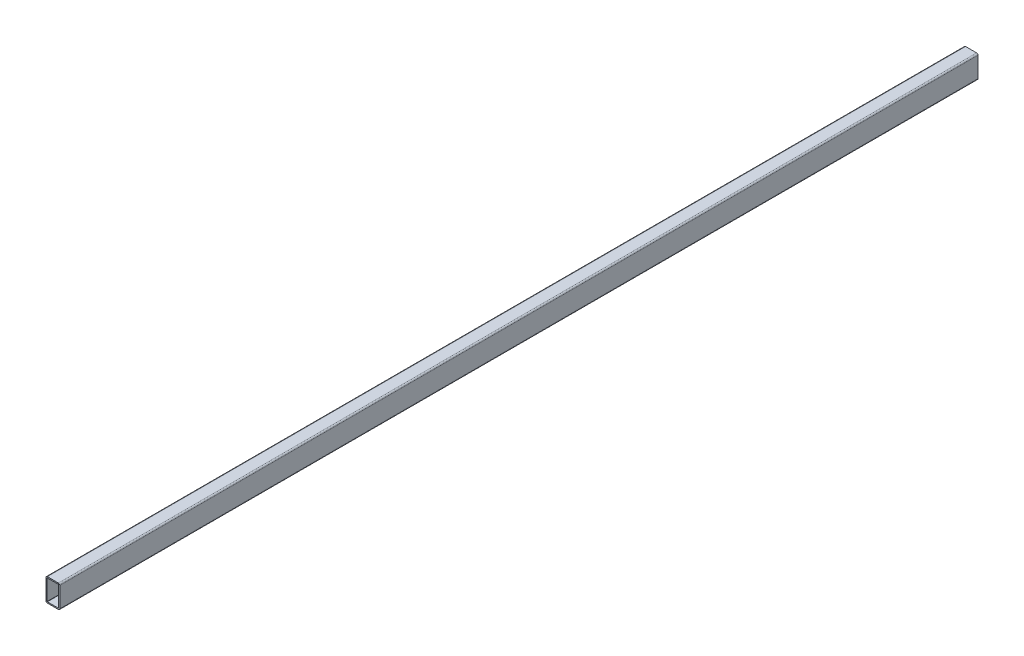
ISO-10303-21;
HEADER;
FILE_DESCRIPTION(('STEP AP214'),'2;1');
FILE_NAME('part.step','',(''),(''),'','','');
FILE_SCHEMA(('AUTOMOTIVE_DESIGN { 1 0 10303 214 1 1 1 1 }'));
ENDSEC;
DATA;
#1=APPLICATION_CONTEXT('core data for automotive mechanical design processes');
#2=APPLICATION_PROTOCOL_DEFINITION('international standard','automotive_design',2000,#1);
#3=PRODUCT_CONTEXT('',#1,'mechanical');
#4=PRODUCT('Part','Part','',(#3));
#5=PRODUCT_RELATED_PRODUCT_CATEGORY('part','',(#4));
#6=PRODUCT_DEFINITION_FORMATION('','',#4);
#7=PRODUCT_DEFINITION_CONTEXT('part definition',#1,'design');
#8=PRODUCT_DEFINITION('design','',#6,#7);
#9=PRODUCT_DEFINITION_SHAPE('','',#8);
#10=(LENGTH_UNIT() NAMED_UNIT(*) SI_UNIT(.MILLI.,.METRE.));
#11=(NAMED_UNIT(*) PLANE_ANGLE_UNIT() SI_UNIT($,.RADIAN.));
#12=(NAMED_UNIT(*) SI_UNIT($,.STERADIAN.) SOLID_ANGLE_UNIT());
#13=UNCERTAINTY_MEASURE_WITH_UNIT(LENGTH_MEASURE(1.E-05),#10,'distance_accuracy_value','');
#14=(GEOMETRIC_REPRESENTATION_CONTEXT(3) GLOBAL_UNCERTAINTY_ASSIGNED_CONTEXT((#13)) GLOBAL_UNIT_ASSIGNED_CONTEXT((#10,
#11,#12)) REPRESENTATION_CONTEXT('',''));
#15=CARTESIAN_POINT('',(0.,0.,0.));
#16=DIRECTION('',(0.,0.,1.));
#17=DIRECTION('',(1.,0.,0.));
#18=AXIS2_PLACEMENT_3D('',#15,#16,#17);
#19=CARTESIAN_POINT('',(-27.,-3.,2000.));
#20=DIRECTION('',(0.,0.,1.));
#21=DIRECTION('',(1.,0.,0.));
#22=AXIS2_PLACEMENT_3D('',#19,#20,#21);
#23=PLANE('',#22);
#24=CARTESIAN_POINT('',(-27.,-3.,2000.));
#25=DIRECTION('',(0.,0.,1.));
#26=DIRECTION('',(1.,0.,0.));
#27=AXIS2_PLACEMENT_3D('',#24,#25,#26);
#28=CIRCLE('',#27,3.);
#29=CARTESIAN_POINT('',(-27.,0.,2000.));
#30=VERTEX_POINT('',#29);
#31=CARTESIAN_POINT('',(-30.,-3.,2000.));
#32=VERTEX_POINT('',#31);
#33=EDGE_CURVE('E214',#30,#32,#28,.T.);
#34=ORIENTED_EDGE('',*,*,#33,.T.);
#35=DIRECTION('',(0.,-1.,0.));
#36=VECTOR('',#35,1.);
#37=CARTESIAN_POINT('',(-30.,-3.,2000.));
#38=LINE('',#37,#36);
#39=CARTESIAN_POINT('',(-30.,-47.,2000.));
#40=VERTEX_POINT('',#39);
#41=EDGE_CURVE('E217',#32,#40,#38,.T.);
#42=ORIENTED_EDGE('',*,*,#41,.T.);
#43=CARTESIAN_POINT('',(-27.,-47.,2000.));
#44=DIRECTION('',(0.,0.,1.));
#45=DIRECTION('',(-1.,0.,0.));
#46=AXIS2_PLACEMENT_3D('',#43,#44,#45);
#47=CIRCLE('',#46,3.);
#48=CARTESIAN_POINT('',(-27.,-50.,2000.));
#49=VERTEX_POINT('',#48);
#50=EDGE_CURVE('E220',#40,#49,#47,.T.);
#51=ORIENTED_EDGE('',*,*,#50,.T.);
#52=DIRECTION('',(1.,0.,0.));
#53=VECTOR('',#52,1.);
#54=CARTESIAN_POINT('',(-2.99999999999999,-50.,2000.));
#55=LINE('',#54,#53);
#56=CARTESIAN_POINT('',(-2.99999999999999,-50.,2000.));
#57=VERTEX_POINT('',#56);
#58=EDGE_CURVE('E222',#49,#57,#55,.T.);
#59=ORIENTED_EDGE('',*,*,#58,.T.);
#60=CARTESIAN_POINT('',(-2.99999999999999,-47.,2000.));
#61=DIRECTION('',(0.,0.,1.));
#62=DIRECTION('',(-1.,0.,0.));
#63=AXIS2_PLACEMENT_3D('',#60,#61,#62);
#64=CIRCLE('',#63,3.);
#65=CARTESIAN_POINT('',(0.,-47.,2000.));
#66=VERTEX_POINT('',#65);
#67=EDGE_CURVE('E224',#57,#66,#64,.T.);
#68=ORIENTED_EDGE('',*,*,#67,.T.);
#69=DIRECTION('',(0.,1.,0.));
#70=VECTOR('',#69,1.);
#71=CARTESIAN_POINT('',(0.,-3.,2000.));
#72=LINE('',#71,#70);
#73=CARTESIAN_POINT('',(0.,-3.,2000.));
#74=VERTEX_POINT('',#73);
#75=EDGE_CURVE('E226',#66,#74,#72,.T.);
#76=ORIENTED_EDGE('',*,*,#75,.T.);
#77=CARTESIAN_POINT('',(-3.,-3.,2000.));
#78=DIRECTION('',(0.,0.,1.));
#79=DIRECTION('',(-1.,0.,0.));
#80=AXIS2_PLACEMENT_3D('',#77,#78,#79);
#81=CIRCLE('',#80,3.);
#82=CARTESIAN_POINT('',(-3.,0.,2000.));
#83=VERTEX_POINT('',#82);
#84=EDGE_CURVE('E228',#74,#83,#81,.T.);
#85=ORIENTED_EDGE('',*,*,#84,.T.);
#86=DIRECTION('',(-1.,0.,0.));
#87=VECTOR('',#86,1.);
#88=CARTESIAN_POINT('',(-3.,0.,2000.));
#89=LINE('',#88,#87);
#90=EDGE_CURVE('E230',#83,#30,#89,.T.);
#91=ORIENTED_EDGE('',*,*,#90,.T.);
#92=EDGE_LOOP('',(#34,#42,#51,#59,#68,#76,#85,#91));
#93=FACE_BOUND('',#92,.T.);
#94=DIRECTION('',(-1.,0.,0.));
#95=VECTOR('',#94,1.);
#96=CARTESIAN_POINT('',(-3.,-2.5,2000.));
#97=LINE('',#96,#95);
#98=CARTESIAN_POINT('',(-3.,-2.5,2000.));
#99=VERTEX_POINT('',#98);
#100=CARTESIAN_POINT('',(-27.,-2.5,2000.));
#101=VERTEX_POINT('',#100);
#102=EDGE_CURVE('E157',#99,#101,#97,.T.);
#103=ORIENTED_EDGE('',*,*,#102,.F.);
#104=CARTESIAN_POINT('',(-3.,-3.,2000.));
#105=DIRECTION('',(0.,0.,1.));
#106=DIRECTION('',(-1.,0.,0.));
#107=AXIS2_PLACEMENT_3D('',#104,#105,#106);
#108=CIRCLE('',#107,0.5);
#109=CARTESIAN_POINT('',(-2.5,-3.,2000.));
#110=VERTEX_POINT('',#109);
#111=EDGE_CURVE('E149',#110,#99,#108,.T.);
#112=ORIENTED_EDGE('',*,*,#111,.F.);
#113=DIRECTION('',(0.,1.,0.));
#114=VECTOR('',#113,1.);
#115=CARTESIAN_POINT('',(-2.5,-3.,2000.));
#116=LINE('',#115,#114);
#117=CARTESIAN_POINT('',(-2.49999999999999,-47.,2000.));
#118=VERTEX_POINT('',#117);
#119=EDGE_CURVE('E182',#118,#110,#116,.T.);
#120=ORIENTED_EDGE('',*,*,#119,.F.);
#121=CARTESIAN_POINT('',(-2.99999999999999,-47.,2000.));
#122=DIRECTION('',(0.,0.,1.));
#123=DIRECTION('',(-1.,0.,0.));
#124=AXIS2_PLACEMENT_3D('',#121,#122,#123);
#125=CIRCLE('',#124,0.5);
#126=CARTESIAN_POINT('',(-2.99999999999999,-47.5,2000.));
#127=VERTEX_POINT('',#126);
#128=EDGE_CURVE('E180',#127,#118,#125,.T.);
#129=ORIENTED_EDGE('',*,*,#128,.F.);
#130=DIRECTION('',(1.,0.,0.));
#131=VECTOR('',#130,1.);
#132=CARTESIAN_POINT('',(-2.99999999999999,-47.5,2000.));
#133=LINE('',#132,#131);
#134=CARTESIAN_POINT('',(-27.,-47.5,2000.));
#135=VERTEX_POINT('',#134);
#136=EDGE_CURVE('E178',#135,#127,#133,.T.);
#137=ORIENTED_EDGE('',*,*,#136,.F.);
#138=CARTESIAN_POINT('',(-27.,-47.,2000.));
#139=DIRECTION('',(0.,0.,1.));
#140=DIRECTION('',(-1.,0.,0.));
#141=AXIS2_PLACEMENT_3D('',#138,#139,#140);
#142=CIRCLE('',#141,0.500000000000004);
#143=CARTESIAN_POINT('',(-27.5,-47.,2000.));
#144=VERTEX_POINT('',#143);
#145=EDGE_CURVE('E176',#144,#135,#142,.T.);
#146=ORIENTED_EDGE('',*,*,#145,.F.);
#147=DIRECTION('',(0.,-1.,0.));
#148=VECTOR('',#147,1.);
#149=CARTESIAN_POINT('',(-27.5,-3.,2000.));
#150=LINE('',#149,#148);
#151=CARTESIAN_POINT('',(-27.5,-3.,2000.));
#152=VERTEX_POINT('',#151);
#153=EDGE_CURVE('E172',#152,#144,#150,.T.);
#154=ORIENTED_EDGE('',*,*,#153,.F.);
#155=CARTESIAN_POINT('',(-27.,-3.,2000.));
#156=DIRECTION('',(0.,0.,1.));
#157=DIRECTION('',(1.,0.,0.));
#158=AXIS2_PLACEMENT_3D('',#155,#156,#157);
#159=CIRCLE('',#158,0.500000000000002);
#160=EDGE_CURVE('E170',#101,#152,#159,.T.);
#161=ORIENTED_EDGE('',*,*,#160,.F.);
#162=EDGE_LOOP('',(#103,#112,#120,#129,#137,#146,#154,#161));
#163=FACE_BOUND('',#162,.T.);
#164=ADVANCED_FACE('F36',(#93,#163),#23,.T.);
#165=CARTESIAN_POINT('',(-27.,-3.,0.));
#166=DIRECTION('',(0.,0.,1.));
#167=DIRECTION('',(1.,0.,0.));
#168=AXIS2_PLACEMENT_3D('',#165,#166,#167);
#169=PLANE('',#168);
#170=CARTESIAN_POINT('',(-27.,-3.,0.));
#171=DIRECTION('',(0.,0.,1.));
#172=DIRECTION('',(1.,0.,0.));
#173=AXIS2_PLACEMENT_3D('',#170,#171,#172);
#174=CIRCLE('',#173,3.);
#175=CARTESIAN_POINT('',(-27.,0.,0.));
#176=VERTEX_POINT('',#175);
#177=CARTESIAN_POINT('',(-30.,-3.,0.));
#178=VERTEX_POINT('',#177);
#179=EDGE_CURVE('E165',#176,#178,#174,.T.);
#180=ORIENTED_EDGE('',*,*,#179,.F.);
#181=DIRECTION('',(-1.,0.,0.));
#182=VECTOR('',#181,1.);
#183=CARTESIAN_POINT('',(-3.,0.,0.));
#184=LINE('',#183,#182);
#185=CARTESIAN_POINT('',(-3.,0.,0.));
#186=VERTEX_POINT('',#185);
#187=EDGE_CURVE('E218',#186,#176,#184,.T.);
#188=ORIENTED_EDGE('',*,*,#187,.F.);
#189=CARTESIAN_POINT('',(-3.,-3.,0.));
#190=DIRECTION('',(0.,0.,1.));
#191=DIRECTION('',(-1.,0.,0.));
#192=AXIS2_PLACEMENT_3D('',#189,#190,#191);
#193=CIRCLE('',#192,3.);
#194=CARTESIAN_POINT('',(0.,-3.,0.));
#195=VERTEX_POINT('',#194);
#196=EDGE_CURVE('E245',#195,#186,#193,.T.);
#197=ORIENTED_EDGE('',*,*,#196,.F.);
#198=DIRECTION('',(0.,1.,0.));
#199=VECTOR('',#198,1.);
#200=CARTESIAN_POINT('',(0.,-3.,0.));
#201=LINE('',#200,#199);
#202=CARTESIAN_POINT('',(0.,-47.,0.));
#203=VERTEX_POINT('',#202);
#204=EDGE_CURVE('E243',#203,#195,#201,.T.);
#205=ORIENTED_EDGE('',*,*,#204,.F.);
#206=CARTESIAN_POINT('',(-2.99999999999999,-47.,0.));
#207=DIRECTION('',(0.,0.,1.));
#208=DIRECTION('',(-1.,0.,0.));
#209=AXIS2_PLACEMENT_3D('',#206,#207,#208);
#210=CIRCLE('',#209,3.);
#211=CARTESIAN_POINT('',(-2.99999999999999,-50.,0.));
#212=VERTEX_POINT('',#211);
#213=EDGE_CURVE('E241',#212,#203,#210,.T.);
#214=ORIENTED_EDGE('',*,*,#213,.F.);
#215=DIRECTION('',(1.,0.,0.));
#216=VECTOR('',#215,1.);
#217=CARTESIAN_POINT('',(-2.99999999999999,-50.,0.));
#218=LINE('',#217,#216);
#219=CARTESIAN_POINT('',(-27.,-50.,0.));
#220=VERTEX_POINT('',#219);
#221=EDGE_CURVE('E239',#220,#212,#218,.T.);
#222=ORIENTED_EDGE('',*,*,#221,.F.);
#223=CARTESIAN_POINT('',(-27.,-47.,0.));
#224=DIRECTION('',(0.,0.,1.));
#225=DIRECTION('',(-1.,0.,0.));
#226=AXIS2_PLACEMENT_3D('',#223,#224,#225);
#227=CIRCLE('',#226,3.);
#228=CARTESIAN_POINT('',(-30.,-47.,0.));
#229=VERTEX_POINT('',#228);
#230=EDGE_CURVE('E237',#229,#220,#227,.T.);
#231=ORIENTED_EDGE('',*,*,#230,.F.);
#232=DIRECTION('',(0.,-1.,0.));
#233=VECTOR('',#232,1.);
#234=CARTESIAN_POINT('',(-30.,-3.,0.));
#235=LINE('',#234,#233);
#236=EDGE_CURVE('E235',#178,#229,#235,.T.);
#237=ORIENTED_EDGE('',*,*,#236,.F.);
#238=EDGE_LOOP('',(#180,#188,#197,#205,#214,#222,#231,#237));
#239=FACE_BOUND('',#238,.T.);
#240=CARTESIAN_POINT('',(-3.,-3.,0.));
#241=DIRECTION('',(0.,0.,1.));
#242=DIRECTION('',(-1.,0.,0.));
#243=AXIS2_PLACEMENT_3D('',#240,#241,#242);
#244=CIRCLE('',#243,0.5);
#245=CARTESIAN_POINT('',(-2.5,-3.,0.));
#246=VERTEX_POINT('',#245);
#247=CARTESIAN_POINT('',(-3.,-2.5,0.));
#248=VERTEX_POINT('',#247);
#249=EDGE_CURVE('E59',#246,#248,#244,.T.);
#250=ORIENTED_EDGE('',*,*,#249,.T.);
#251=DIRECTION('',(-1.,0.,0.));
#252=VECTOR('',#251,1.);
#253=CARTESIAN_POINT('',(-3.,-2.5,0.));
#254=LINE('',#253,#252);
#255=CARTESIAN_POINT('',(-27.,-2.5,0.));
#256=VERTEX_POINT('',#255);
#257=EDGE_CURVE('E164',#248,#256,#254,.T.);
#258=ORIENTED_EDGE('',*,*,#257,.T.);
#259=CARTESIAN_POINT('',(-27.,-3.,0.));
#260=DIRECTION('',(0.,0.,1.));
#261=DIRECTION('',(1.,0.,0.));
#262=AXIS2_PLACEMENT_3D('',#259,#260,#261);
#263=CIRCLE('',#262,0.500000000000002);
#264=CARTESIAN_POINT('',(-27.5,-3.,0.));
#265=VERTEX_POINT('',#264);
#266=EDGE_CURVE('E186',#256,#265,#263,.T.);
#267=ORIENTED_EDGE('',*,*,#266,.T.);
#268=DIRECTION('',(0.,-1.,0.));
#269=VECTOR('',#268,1.);
#270=CARTESIAN_POINT('',(-27.5,-3.,0.));
#271=LINE('',#270,#269);
#272=CARTESIAN_POINT('',(-27.5,-47.,0.));
#273=VERTEX_POINT('',#272);
#274=EDGE_CURVE('E189',#265,#273,#271,.T.);
#275=ORIENTED_EDGE('',*,*,#274,.T.);
#276=CARTESIAN_POINT('',(-27.,-47.,0.));
#277=DIRECTION('',(0.,0.,1.));
#278=DIRECTION('',(-1.,0.,0.));
#279=AXIS2_PLACEMENT_3D('',#276,#277,#278);
#280=CIRCLE('',#279,0.500000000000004);
#281=CARTESIAN_POINT('',(-27.,-47.5,0.));
#282=VERTEX_POINT('',#281);
#283=EDGE_CURVE('E192',#273,#282,#280,.T.);
#284=ORIENTED_EDGE('',*,*,#283,.T.);
#285=DIRECTION('',(1.,0.,0.));
#286=VECTOR('',#285,1.);
#287=CARTESIAN_POINT('',(-2.99999999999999,-47.5,0.));
#288=LINE('',#287,#286);
#289=CARTESIAN_POINT('',(-2.99999999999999,-47.5,0.));
#290=VERTEX_POINT('',#289);
#291=EDGE_CURVE('E195',#282,#290,#288,.T.);
#292=ORIENTED_EDGE('',*,*,#291,.T.);
#293=CARTESIAN_POINT('',(-2.99999999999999,-47.,0.));
#294=DIRECTION('',(0.,0.,1.));
#295=DIRECTION('',(-1.,0.,0.));
#296=AXIS2_PLACEMENT_3D('',#293,#294,#295);
#297=CIRCLE('',#296,0.5);
#298=CARTESIAN_POINT('',(-2.49999999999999,-47.,0.));
#299=VERTEX_POINT('',#298);
#300=EDGE_CURVE('E198',#290,#299,#297,.T.);
#301=ORIENTED_EDGE('',*,*,#300,.T.);
#302=DIRECTION('',(0.,1.,0.));
#303=VECTOR('',#302,1.);
#304=CARTESIAN_POINT('',(-2.5,-3.,0.));
#305=LINE('',#304,#303);
#306=EDGE_CURVE('E158',#299,#246,#305,.T.);
#307=ORIENTED_EDGE('',*,*,#306,.T.);
#308=EDGE_LOOP('',(#250,#258,#267,#275,#284,#292,#301,#307));
#309=FACE_BOUND('',#308,.T.);
#310=ADVANCED_FACE('F275',(#239,#309),#169,.F.);
#311=CARTESIAN_POINT('',(-27.,-3.,2000.));
#312=DIRECTION('',(0.,0.,-1.));
#313=DIRECTION('',(-1.,0.,0.));
#314=AXIS2_PLACEMENT_3D('',#311,#312,#313);
#315=CYLINDRICAL_SURFACE('',#314,3.);
#316=ORIENTED_EDGE('',*,*,#179,.T.);
#317=DIRECTION('',(0.,0.,-1.));
#318=VECTOR('',#317,1.);
#319=CARTESIAN_POINT('',(-30.,-3.,2000.));
#320=LINE('',#319,#318);
#321=EDGE_CURVE('E11',#32,#178,#320,.T.);
#322=ORIENTED_EDGE('',*,*,#321,.F.);
#323=ORIENTED_EDGE('',*,*,#33,.F.);
#324=DIRECTION('',(0.,0.,-1.));
#325=VECTOR('',#324,1.);
#326=CARTESIAN_POINT('',(-27.,0.,2000.));
#327=LINE('',#326,#325);
#328=EDGE_CURVE('E232',#30,#176,#327,.T.);
#329=ORIENTED_EDGE('',*,*,#328,.T.);
#330=EDGE_LOOP('',(#316,#322,#323,#329));
#331=FACE_BOUND('',#330,.T.);
#332=ADVANCED_FACE('F38',(#331),#315,.T.);
#333=CARTESIAN_POINT('',(-30.,-3.,2000.));
#334=DIRECTION('',(1.,0.,0.));
#335=DIRECTION('',(0.,1.,0.));
#336=AXIS2_PLACEMENT_3D('',#333,#334,#335);
#337=PLANE('',#336);
#338=ORIENTED_EDGE('',*,*,#236,.T.);
#339=DIRECTION('',(0.,0.,-1.));
#340=VECTOR('',#339,1.);
#341=CARTESIAN_POINT('',(-30.,-47.,2000.));
#342=LINE('',#341,#340);
#343=EDGE_CURVE('E44',#40,#229,#342,.T.);
#344=ORIENTED_EDGE('',*,*,#343,.F.);
#345=ORIENTED_EDGE('',*,*,#41,.F.);
#346=ORIENTED_EDGE('',*,*,#321,.T.);
#347=EDGE_LOOP('',(#338,#344,#345,#346));
#348=FACE_BOUND('',#347,.T.);
#349=ADVANCED_FACE('F292',(#348),#337,.F.);
#350=CARTESIAN_POINT('',(-27.,-47.,2000.));
#351=DIRECTION('',(0.,0.,-1.));
#352=DIRECTION('',(-1.,0.,0.));
#353=AXIS2_PLACEMENT_3D('',#350,#351,#352);
#354=CYLINDRICAL_SURFACE('',#353,3.);
#355=ORIENTED_EDGE('',*,*,#230,.T.);
#356=DIRECTION('',(0.,0.,-1.));
#357=VECTOR('',#356,1.);
#358=CARTESIAN_POINT('',(-27.,-50.,2000.));
#359=LINE('',#358,#357);
#360=EDGE_CURVE('E262',#49,#220,#359,.T.);
#361=ORIENTED_EDGE('',*,*,#360,.F.);
#362=ORIENTED_EDGE('',*,*,#50,.F.);
#363=ORIENTED_EDGE('',*,*,#343,.T.);
#364=EDGE_LOOP('',(#355,#361,#362,#363));
#365=FACE_BOUND('',#364,.T.);
#366=ADVANCED_FACE('F269',(#365),#354,.T.);
#367=CARTESIAN_POINT('',(-2.99999999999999,-50.,2000.));
#368=DIRECTION('',(0.,1.,0.));
#369=DIRECTION('',(-1.,0.,0.));
#370=AXIS2_PLACEMENT_3D('',#367,#368,#369);
#371=PLANE('',#370);
#372=ORIENTED_EDGE('',*,*,#221,.T.);
#373=DIRECTION('',(0.,0.,-1.));
#374=VECTOR('',#373,1.);
#375=CARTESIAN_POINT('',(-2.99999999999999,-50.,2000.));
#376=LINE('',#375,#374);
#377=EDGE_CURVE('E259',#57,#212,#376,.T.);
#378=ORIENTED_EDGE('',*,*,#377,.F.);
#379=ORIENTED_EDGE('',*,*,#58,.F.);
#380=ORIENTED_EDGE('',*,*,#360,.T.);
#381=EDGE_LOOP('',(#372,#378,#379,#380));
#382=FACE_BOUND('',#381,.T.);
#383=ADVANCED_FACE('F281',(#382),#371,.F.);
#384=CARTESIAN_POINT('',(-2.99999999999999,-47.,2000.));
#385=DIRECTION('',(0.,0.,-1.));
#386=DIRECTION('',(-1.,0.,0.));
#387=AXIS2_PLACEMENT_3D('',#384,#385,#386);
#388=CYLINDRICAL_SURFACE('',#387,3.);
#389=ORIENTED_EDGE('',*,*,#213,.T.);
#390=DIRECTION('',(0.,0.,-1.));
#391=VECTOR('',#390,1.);
#392=CARTESIAN_POINT('',(0.,-47.,2000.));
#393=LINE('',#392,#391);
#394=EDGE_CURVE('E256',#66,#203,#393,.T.);
#395=ORIENTED_EDGE('',*,*,#394,.F.);
#396=ORIENTED_EDGE('',*,*,#67,.F.);
#397=ORIENTED_EDGE('',*,*,#377,.T.);
#398=EDGE_LOOP('',(#389,#395,#396,#397));
#399=FACE_BOUND('',#398,.T.);
#400=ADVANCED_FACE('F285',(#399),#388,.T.);
#401=CARTESIAN_POINT('',(0.,-3.,2000.));
#402=DIRECTION('',(-1.,0.,0.));
#403=DIRECTION('',(0.,-1.,0.));
#404=AXIS2_PLACEMENT_3D('',#401,#402,#403);
#405=PLANE('',#404);
#406=ORIENTED_EDGE('',*,*,#204,.T.);
#407=DIRECTION('',(0.,0.,-1.));
#408=VECTOR('',#407,1.);
#409=CARTESIAN_POINT('',(0.,-3.,2000.));
#410=LINE('',#409,#408);
#411=EDGE_CURVE('E253',#74,#195,#410,.T.);
#412=ORIENTED_EDGE('',*,*,#411,.F.);
#413=ORIENTED_EDGE('',*,*,#75,.F.);
#414=ORIENTED_EDGE('',*,*,#394,.T.);
#415=EDGE_LOOP('',(#406,#412,#413,#414));
#416=FACE_BOUND('',#415,.T.);
#417=ADVANCED_FACE('F305',(#416),#405,.F.);
#418=CARTESIAN_POINT('',(-3.,-3.,2000.));
#419=DIRECTION('',(0.,0.,-1.));
#420=DIRECTION('',(-1.,0.,0.));
#421=AXIS2_PLACEMENT_3D('',#418,#419,#420);
#422=CYLINDRICAL_SURFACE('',#421,3.);
#423=ORIENTED_EDGE('',*,*,#196,.T.);
#424=DIRECTION('',(0.,0.,-1.));
#425=VECTOR('',#424,1.);
#426=CARTESIAN_POINT('',(-3.,0.,2000.));
#427=LINE('',#426,#425);
#428=EDGE_CURVE('E250',#83,#186,#427,.T.);
#429=ORIENTED_EDGE('',*,*,#428,.F.);
#430=ORIENTED_EDGE('',*,*,#84,.F.);
#431=ORIENTED_EDGE('',*,*,#411,.T.);
#432=EDGE_LOOP('',(#423,#429,#430,#431));
#433=FACE_BOUND('',#432,.T.);
#434=ADVANCED_FACE('F303',(#433),#422,.T.);
#435=CARTESIAN_POINT('',(-3.,0.,2000.));
#436=DIRECTION('',(0.,-1.,0.));
#437=DIRECTION('',(1.,0.,0.));
#438=AXIS2_PLACEMENT_3D('',#435,#436,#437);
#439=PLANE('',#438);
#440=ORIENTED_EDGE('',*,*,#187,.T.);
#441=ORIENTED_EDGE('',*,*,#328,.F.);
#442=ORIENTED_EDGE('',*,*,#90,.F.);
#443=ORIENTED_EDGE('',*,*,#428,.T.);
#444=EDGE_LOOP('',(#440,#441,#442,#443));
#445=FACE_BOUND('',#444,.T.);
#446=ADVANCED_FACE('F298',(#445),#439,.F.);
#447=CARTESIAN_POINT('',(-3.,-3.,2000.));
#448=DIRECTION('',(0.,0.,-1.));
#449=DIRECTION('',(-1.,0.,0.));
#450=AXIS2_PLACEMENT_3D('',#447,#448,#449);
#451=CYLINDRICAL_SURFACE('',#450,0.5);
#452=ORIENTED_EDGE('',*,*,#249,.F.);
#453=DIRECTION('',(0.,0.,-1.));
#454=VECTOR('',#453,1.);
#455=CARTESIAN_POINT('',(-2.5,-3.,2000.));
#456=LINE('',#455,#454);
#457=EDGE_CURVE('E153',#110,#246,#456,.T.);
#458=ORIENTED_EDGE('',*,*,#457,.F.);
#459=ORIENTED_EDGE('',*,*,#111,.T.);
#460=DIRECTION('',(0.,0.,-1.));
#461=VECTOR('',#460,1.);
#462=CARTESIAN_POINT('',(-3.,-2.5,2000.));
#463=LINE('',#462,#461);
#464=EDGE_CURVE('E152',#99,#248,#463,.T.);
#465=ORIENTED_EDGE('',*,*,#464,.T.);
#466=EDGE_LOOP('',(#452,#458,#459,#465));
#467=FACE_BOUND('',#466,.T.);
#468=ADVANCED_FACE('F151',(#467),#451,.F.);
#469=CARTESIAN_POINT('',(-3.,-2.5,2000.));
#470=DIRECTION('',(0.,-1.,0.));
#471=DIRECTION('',(0.,0.,-1.));
#472=AXIS2_PLACEMENT_3D('',#469,#470,#471);
#473=PLANE('',#472);
#474=ORIENTED_EDGE('',*,*,#257,.F.);
#475=ORIENTED_EDGE('',*,*,#464,.F.);
#476=ORIENTED_EDGE('',*,*,#102,.T.);
#477=DIRECTION('',(0.,0.,-1.));
#478=VECTOR('',#477,1.);
#479=CARTESIAN_POINT('',(-27.,-2.5,2000.));
#480=LINE('',#479,#478);
#481=EDGE_CURVE('E166',#101,#256,#480,.T.);
#482=ORIENTED_EDGE('',*,*,#481,.T.);
#483=EDGE_LOOP('',(#474,#475,#476,#482));
#484=FACE_BOUND('',#483,.T.);
#485=ADVANCED_FACE('F161',(#484),#473,.T.);
#486=CARTESIAN_POINT('',(-27.,-3.,2000.));
#487=DIRECTION('',(0.,0.,-1.));
#488=DIRECTION('',(-1.,0.,0.));
#489=AXIS2_PLACEMENT_3D('',#486,#487,#488);
#490=CYLINDRICAL_SURFACE('',#489,0.500000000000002);
#491=ORIENTED_EDGE('',*,*,#266,.F.);
#492=ORIENTED_EDGE('',*,*,#481,.F.);
#493=ORIENTED_EDGE('',*,*,#160,.T.);
#494=DIRECTION('',(0.,0.,-1.));
#495=VECTOR('',#494,1.);
#496=CARTESIAN_POINT('',(-27.5,-3.,2000.));
#497=LINE('',#496,#495);
#498=EDGE_CURVE('E211',#152,#265,#497,.T.);
#499=ORIENTED_EDGE('',*,*,#498,.T.);
#500=EDGE_LOOP('',(#491,#492,#493,#499));
#501=FACE_BOUND('',#500,.T.);
#502=ADVANCED_FACE('F330',(#501),#490,.F.);
#503=CARTESIAN_POINT('',(-27.5,-3.,2000.));
#504=DIRECTION('',(1.,0.,0.));
#505=DIRECTION('',(0.,0.,-1.));
#506=AXIS2_PLACEMENT_3D('',#503,#504,#505);
#507=PLANE('',#506);
#508=ORIENTED_EDGE('',*,*,#274,.F.);
#509=ORIENTED_EDGE('',*,*,#498,.F.);
#510=ORIENTED_EDGE('',*,*,#153,.T.);
#511=DIRECTION('',(0.,0.,-1.));
#512=VECTOR('',#511,1.);
#513=CARTESIAN_POINT('',(-27.5,-47.,2000.));
#514=LINE('',#513,#512);
#515=EDGE_CURVE('E209',#144,#273,#514,.T.);
#516=ORIENTED_EDGE('',*,*,#515,.T.);
#517=EDGE_LOOP('',(#508,#509,#510,#516));
#518=FACE_BOUND('',#517,.T.);
#519=ADVANCED_FACE('F334',(#518),#507,.T.);
#520=CARTESIAN_POINT('',(-27.,-47.,2000.));
#521=DIRECTION('',(0.,0.,-1.));
#522=DIRECTION('',(-1.,0.,0.));
#523=AXIS2_PLACEMENT_3D('',#520,#521,#522);
#524=CYLINDRICAL_SURFACE('',#523,0.500000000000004);
#525=ORIENTED_EDGE('',*,*,#283,.F.);
#526=ORIENTED_EDGE('',*,*,#515,.F.);
#527=ORIENTED_EDGE('',*,*,#145,.T.);
#528=DIRECTION('',(0.,0.,-1.));
#529=VECTOR('',#528,1.);
#530=CARTESIAN_POINT('',(-27.,-47.5,2000.));
#531=LINE('',#530,#529);
#532=EDGE_CURVE('E207',#135,#282,#531,.T.);
#533=ORIENTED_EDGE('',*,*,#532,.T.);
#534=EDGE_LOOP('',(#525,#526,#527,#533));
#535=FACE_BOUND('',#534,.T.);
#536=ADVANCED_FACE('F340',(#535),#524,.F.);
#537=CARTESIAN_POINT('',(-2.99999999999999,-47.5,2000.));
#538=DIRECTION('',(0.,1.,0.));
#539=DIRECTION('',(0.,0.,1.));
#540=AXIS2_PLACEMENT_3D('',#537,#538,#539);
#541=PLANE('',#540);
#542=ORIENTED_EDGE('',*,*,#291,.F.);
#543=ORIENTED_EDGE('',*,*,#532,.F.);
#544=ORIENTED_EDGE('',*,*,#136,.T.);
#545=DIRECTION('',(0.,0.,-1.));
#546=VECTOR('',#545,1.);
#547=CARTESIAN_POINT('',(-2.99999999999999,-47.5,2000.));
#548=LINE('',#547,#546);
#549=EDGE_CURVE('E205',#127,#290,#548,.T.);
#550=ORIENTED_EDGE('',*,*,#549,.T.);
#551=EDGE_LOOP('',(#542,#543,#544,#550));
#552=FACE_BOUND('',#551,.T.);
#553=ADVANCED_FACE('F344',(#552),#541,.T.);
#554=CARTESIAN_POINT('',(-2.99999999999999,-47.,2000.));
#555=DIRECTION('',(0.,0.,-1.));
#556=DIRECTION('',(-1.,0.,0.));
#557=AXIS2_PLACEMENT_3D('',#554,#555,#556);
#558=CYLINDRICAL_SURFACE('',#557,0.5);
#559=ORIENTED_EDGE('',*,*,#300,.F.);
#560=ORIENTED_EDGE('',*,*,#549,.F.);
#561=ORIENTED_EDGE('',*,*,#128,.T.);
#562=DIRECTION('',(0.,0.,-1.));
#563=VECTOR('',#562,1.);
#564=CARTESIAN_POINT('',(-2.49999999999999,-47.,2000.));
#565=LINE('',#564,#563);
#566=EDGE_CURVE('E51',#118,#299,#565,.T.);
#567=ORIENTED_EDGE('',*,*,#566,.T.);
#568=EDGE_LOOP('',(#559,#560,#561,#567));
#569=FACE_BOUND('',#568,.T.);
#570=ADVANCED_FACE('F348',(#569),#558,.F.);
#571=CARTESIAN_POINT('',(-2.5,-3.,2000.));
#572=DIRECTION('',(-1.,0.,0.));
#573=DIRECTION('',(0.,-1.,0.));
#574=AXIS2_PLACEMENT_3D('',#571,#572,#573);
#575=PLANE('',#574);
#576=ORIENTED_EDGE('',*,*,#306,.F.);
#577=ORIENTED_EDGE('',*,*,#566,.F.);
#578=ORIENTED_EDGE('',*,*,#119,.T.);
#579=ORIENTED_EDGE('',*,*,#457,.T.);
#580=EDGE_LOOP('',(#576,#577,#578,#579));
#581=FACE_BOUND('',#580,.T.);
#582=ADVANCED_FACE('F352',(#581),#575,.T.);
#583=CLOSED_SHELL('',(#164,#310,#332,#349,#366,#383,#400,#417,#434,#446,#468,#485,#502,#519,
#536,#553,#570,#582));
#584=MANIFOLD_SOLID_BREP('B2',#583);
#585=ADVANCED_BREP_SHAPE_REPRESENTATION('',(#18,#584),#14);
#586=SHAPE_DEFINITION_REPRESENTATION(#9,#585);
ENDSEC;
END-ISO-10303-21;
